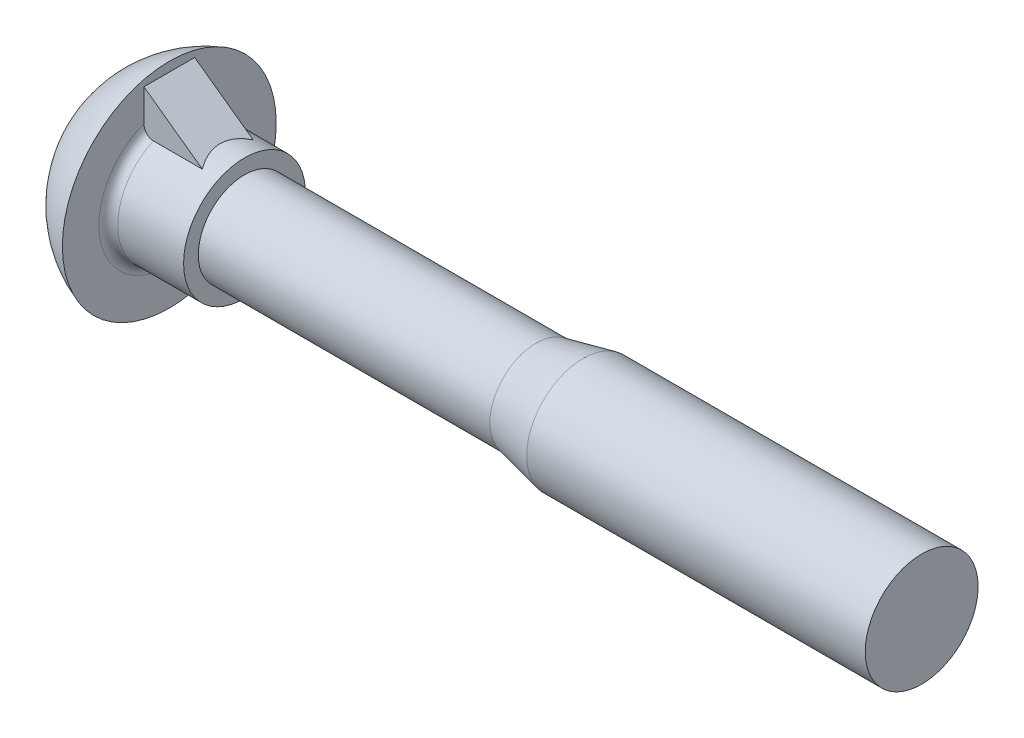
ISO-10303-21;
HEADER;
FILE_DESCRIPTION(('STEP AP214'),'2;1');
FILE_NAME('part.step','',(''),(''),'','','');
FILE_SCHEMA(('AUTOMOTIVE_DESIGN { 1 0 10303 214 1 1 1 1 }'));
ENDSEC;
DATA;
#1=APPLICATION_CONTEXT('core data for automotive mechanical design processes');
#2=APPLICATION_PROTOCOL_DEFINITION('international standard','automotive_design',2000,#1);
#3=PRODUCT_CONTEXT('',#1,'mechanical');
#4=PRODUCT('Part','Part','',(#3));
#5=PRODUCT_RELATED_PRODUCT_CATEGORY('part','',(#4));
#6=PRODUCT_DEFINITION_FORMATION('','',#4);
#7=PRODUCT_DEFINITION_CONTEXT('part definition',#1,'design');
#8=PRODUCT_DEFINITION('design','',#6,#7);
#9=PRODUCT_DEFINITION_SHAPE('','',#8);
#10=(LENGTH_UNIT() NAMED_UNIT(*) SI_UNIT(.MILLI.,.METRE.));
#11=(NAMED_UNIT(*) PLANE_ANGLE_UNIT() SI_UNIT($,.RADIAN.));
#12=(NAMED_UNIT(*) SI_UNIT($,.STERADIAN.) SOLID_ANGLE_UNIT());
#13=UNCERTAINTY_MEASURE_WITH_UNIT(LENGTH_MEASURE(1.E-05),#10,'distance_accuracy_value','');
#14=(GEOMETRIC_REPRESENTATION_CONTEXT(3) GLOBAL_UNCERTAINTY_ASSIGNED_CONTEXT((#13)) GLOBAL_UNIT_ASSIGNED_CONTEXT((#10,
#11,#12)) REPRESENTATION_CONTEXT('',''));
#15=CARTESIAN_POINT('',(0.,0.,0.));
#16=DIRECTION('',(0.,0.,1.));
#17=DIRECTION('',(1.,0.,0.));
#18=AXIS2_PLACEMENT_3D('',#15,#16,#17);
#19=CARTESIAN_POINT('',(4.58,0.,0.));
#20=DIRECTION('',(-1.,0.,0.));
#21=DIRECTION('',(0.,0.,1.));
#22=AXIS2_PLACEMENT_3D('',#19,#20,#21);
#23=TOROIDAL_SURFACE('',#22,3.74000000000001,0.5);
#24=CARTESIAN_POINT('',(4.27855518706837,3.05620140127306,1.35));
#25=CARTESIAN_POINT('',(4.25509222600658,3.07558616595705,1.35));
#26=CARTESIAN_POINT('',(4.23333891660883,3.09709315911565,1.35));
#27=CARTESIAN_POINT('',(4.19377598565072,3.14351633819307,1.35));
#28=CARTESIAN_POINT('',(4.17597568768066,3.16844036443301,1.35));
#29=CARTESIAN_POINT('',(4.14475397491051,3.22077385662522,1.35));
#30=CARTESIAN_POINT('',(4.13131761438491,3.24817441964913,1.35));
#31=CARTESIAN_POINT('',(4.10898689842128,3.30474701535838,1.35));
#32=CARTESIAN_POINT('',(4.10009071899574,3.33391833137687,1.35));
#33=CARTESIAN_POINT('',(4.0866653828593,3.39480417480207,1.35));
#34=CARTESIAN_POINT('',(4.0823800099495,3.42657269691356,1.35));
#35=CARTESIAN_POINT('',(4.07911978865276,3.49038954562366,1.35));
#36=CARTESIAN_POINT('',(4.08014633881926,3.52243794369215,1.35));
#37=CARTESIAN_POINT('',(4.0876044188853,3.58634778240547,1.35));
#38=CARTESIAN_POINT('',(4.09410905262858,3.61820079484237,1.35));
#39=CARTESIAN_POINT('',(4.11255369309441,3.68029787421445,1.35));
#40=CARTESIAN_POINT('',(4.12449293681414,3.71054216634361,1.35));
#41=CARTESIAN_POINT('',(4.1531129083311,3.76746837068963,1.35));
#42=CARTESIAN_POINT('',(4.16962594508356,3.79423439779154,1.35));
#43=CARTESIAN_POINT('',(4.20716929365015,3.84438967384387,1.35));
#44=CARTESIAN_POINT('',(4.22819802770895,3.86778009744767,1.35));
#45=CARTESIAN_POINT('',(4.27287749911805,3.90906375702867,1.35));
#46=CARTESIAN_POINT('',(4.29630718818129,3.92719616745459,1.35));
#47=CARTESIAN_POINT('',(4.34602673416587,3.95899047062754,1.35));
#48=CARTESIAN_POINT('',(4.37231553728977,3.97265400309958,1.35));
#49=CARTESIAN_POINT('',(4.42540303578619,3.99433569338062,1.35));
#50=CARTESIAN_POINT('',(4.45208987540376,4.00262816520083,1.35));
#51=CARTESIAN_POINT('',(4.50649975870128,4.01443225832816,1.35));
#52=CARTESIAN_POINT('',(4.53422254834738,4.01794504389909,1.35));
#53=CARTESIAN_POINT('',(4.58887541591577,4.0200184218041,1.35));
#54=CARTESIAN_POINT('',(4.61579922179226,4.0187482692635,1.35));
#55=CARTESIAN_POINT('',(4.66904340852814,4.01167983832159,1.35));
#56=CARTESIAN_POINT('',(4.69536383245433,4.00588188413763,1.35));
#57=CARTESIAN_POINT('',(4.74653524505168,3.99000557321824,1.35));
#58=CARTESIAN_POINT('',(4.77139277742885,3.97994824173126,1.35));
#59=CARTESIAN_POINT('',(4.81912300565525,3.9559007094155,1.35));
#60=CARTESIAN_POINT('',(4.84199554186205,3.94191019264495,1.35));
#61=CARTESIAN_POINT('',(4.88573665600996,3.91005488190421,1.35));
#62=CARTESIAN_POINT('',(4.90654133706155,3.89210247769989,1.35));
#63=CARTESIAN_POINT('',(4.94500824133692,3.85310255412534,1.35));
#64=CARTESIAN_POINT('',(4.9626698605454,3.83205444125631,1.35));
#65=CARTESIAN_POINT('',(4.99525393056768,3.78641018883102,1.35));
#66=CARTESIAN_POINT('',(5.01000696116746,3.76169319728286,1.35));
#67=CARTESIAN_POINT('',(5.03541218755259,3.71023711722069,1.35));
#68=CARTESIAN_POINT('',(5.04606332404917,3.68349750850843,1.35));
#69=CARTESIAN_POINT('',(5.0635994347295,3.62712355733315,1.35));
#70=CARTESIAN_POINT('',(5.07023353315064,3.59741114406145,1.35));
#71=CARTESIAN_POINT('',(5.07867680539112,3.53730836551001,1.35));
#72=CARTESIAN_POINT('',(5.08048466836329,3.50691781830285,1.35));
#73=CARTESIAN_POINT('',(5.07926490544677,3.4447355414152,1.35));
#74=CARTESIAN_POINT('',(5.07599518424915,3.41294837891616,1.35));
#75=CARTESIAN_POINT('',(5.06426982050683,3.350339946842,1.35));
#76=CARTESIAN_POINT('',(5.05581311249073,3.31951887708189,1.35));
#77=CARTESIAN_POINT('',(5.03369254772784,3.25916247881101,1.35));
#78=CARTESIAN_POINT('',(5.01993715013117,3.22966054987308,1.35));
#79=CARTESIAN_POINT('',(4.98750915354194,3.17348346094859,1.35));
#80=CARTESIAN_POINT('',(4.96883682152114,3.14680814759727,1.35));
#81=CARTESIAN_POINT('',(4.92766860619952,3.09807233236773,1.35));
#82=CARTESIAN_POINT('',(4.90531885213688,3.07588880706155,1.35));
#83=CARTESIAN_POINT('',(4.85693134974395,3.03598619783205,1.35));
#84=CARTESIAN_POINT('',(4.83089573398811,3.01826454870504,1.35));
#85=CARTESIAN_POINT('',(4.77810417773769,2.98935722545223,1.35));
#86=CARTESIAN_POINT('',(4.75157283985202,2.97776182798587,1.35));
#87=CARTESIAN_POINT('',(4.69683239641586,2.95965310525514,1.35));
#88=CARTESIAN_POINT('',(4.66862447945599,2.95313622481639,1.35));
#89=CARTESIAN_POINT('',(4.61386642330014,2.94584791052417,1.35));
#90=CARTESIAN_POINT('',(4.58737313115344,2.9446443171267,1.35));
#91=CARTESIAN_POINT('',(4.53457499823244,2.94685690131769,1.35));
#92=CARTESIAN_POINT('',(4.50827017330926,2.95027346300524,1.35));
#93=CARTESIAN_POINT('',(4.45741721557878,2.96139141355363,1.35));
#94=CARTESIAN_POINT('',(4.43284008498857,2.96896188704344,1.35));
#95=CARTESIAN_POINT('',(4.38525991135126,2.98797094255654,1.35));
#96=CARTESIAN_POINT('',(4.36225501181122,2.99940486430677,1.35));
#97=CARTESIAN_POINT('',(4.32947205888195,3.01902693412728,1.35));
#98=CARTESIAN_POINT('',(4.31889899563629,3.02592358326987,1.35));
#99=CARTESIAN_POINT('',(4.29830444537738,3.04049243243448,1.35));
#100=CARTESIAN_POINT('',(4.28828287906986,3.04816452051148,1.35));
#101=CARTESIAN_POINT('',(4.27855518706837,3.05620140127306,1.35));
#102=B_SPLINE_CURVE_WITH_KNOTS('',3,(#24,#25,#26,#27,#28,#29,#30,#31,#32,#33,#34,#35,#36,#37,
#38,#39,#40,#41,#42,#43,#44,#45,#46,#47,#48,#49,#50,#51,#52,#53,#54,#55,#56,#57,#58,#59,#60,#61,
#62,#63,#64,#65,#66,#67,#68,#69,#70,#71,#72,#73,#74,#75,#76,#77,#78,#79,#80,#81,#82,#83,#84,#85,
#86,#87,#88,#89,#90,#91,#92,#93,#94,#95,#96,#97,#98,#99,#100,#101),.UNSPECIFIED.,.T.,.F.,(4,2,2,
2,2,2,2,2,2,2,2,2,2,2,2,2,2,2,2,2,2,2,2,2,2,2,2,2,2,2,2,2,2,2,2,2,2,2,4),(0.,0.091255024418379,
0.182723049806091,0.273874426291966,0.364989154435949,0.460714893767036,0.556465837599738,
0.653515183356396,0.750550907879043,0.844415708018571,0.938247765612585,1.02667039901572,
1.1150605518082,1.19847888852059,1.28187690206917,1.36235188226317,1.44282110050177,
1.52289765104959,1.60298063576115,1.68505302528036,1.76714117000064,1.85311847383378,
1.93911796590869,2.03004702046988,2.12100076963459,2.21642605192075,2.31187094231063,
2.40904459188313,2.50621296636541,2.60018213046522,2.69409714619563,2.78049226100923,
2.86682684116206,2.94599227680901,3.02516429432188,3.1019735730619,3.17869052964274,
3.2165301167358,3.25436424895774),.UNSPECIFIED.);
#103=CARTESIAN_POINT('',(4.58,2.94535227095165,1.35));
#104=VERTEX_POINT('',#103);
#105=CARTESIAN_POINT('',(4.08,3.487850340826,1.35));
#106=VERTEX_POINT('',#105);
#107=EDGE_CURVE('E163',#104,#106,#102,.T.);
#108=ORIENTED_EDGE('',*,*,#107,.T.);
#109=CARTESIAN_POINT('',(4.08,0.,0.));
#110=DIRECTION('',(-1.,0.,0.));
#111=DIRECTION('',(0.,0.,1.));
#112=AXIS2_PLACEMENT_3D('',#109,#110,#111);
#113=CIRCLE('',#112,3.74000000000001);
#114=CARTESIAN_POINT('',(4.08,3.487850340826,-1.35));
#115=VERTEX_POINT('',#114);
#116=EDGE_CURVE('E166',#115,#106,#113,.T.);
#117=ORIENTED_EDGE('',*,*,#116,.F.);
#118=CARTESIAN_POINT('',(4.27855518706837,3.05620140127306,-1.35));
#119=CARTESIAN_POINT('',(4.25509222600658,3.07558616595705,-1.35));
#120=CARTESIAN_POINT('',(4.23333891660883,3.09709315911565,-1.35));
#121=CARTESIAN_POINT('',(4.19377598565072,3.14351633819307,-1.35));
#122=CARTESIAN_POINT('',(4.17597568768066,3.16844036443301,-1.35));
#123=CARTESIAN_POINT('',(4.14475397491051,3.22077385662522,-1.35));
#124=CARTESIAN_POINT('',(4.13131761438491,3.24817441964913,-1.35));
#125=CARTESIAN_POINT('',(4.10898689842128,3.30474701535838,-1.35));
#126=CARTESIAN_POINT('',(4.10009071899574,3.33391833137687,-1.35));
#127=CARTESIAN_POINT('',(4.0866653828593,3.39480417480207,-1.35));
#128=CARTESIAN_POINT('',(4.0823800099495,3.42657269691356,-1.35));
#129=CARTESIAN_POINT('',(4.07911978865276,3.49038954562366,-1.35));
#130=CARTESIAN_POINT('',(4.08014633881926,3.52243794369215,-1.35));
#131=CARTESIAN_POINT('',(4.0876044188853,3.58634778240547,-1.35));
#132=CARTESIAN_POINT('',(4.09410905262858,3.61820079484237,-1.35));
#133=CARTESIAN_POINT('',(4.11255369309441,3.68029787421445,-1.35));
#134=CARTESIAN_POINT('',(4.12449293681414,3.71054216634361,-1.35));
#135=CARTESIAN_POINT('',(4.1531129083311,3.76746837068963,-1.35));
#136=CARTESIAN_POINT('',(4.16962594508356,3.79423439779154,-1.35));
#137=CARTESIAN_POINT('',(4.20716929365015,3.84438967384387,-1.35));
#138=CARTESIAN_POINT('',(4.22819802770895,3.86778009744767,-1.35));
#139=CARTESIAN_POINT('',(4.27287749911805,3.90906375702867,-1.35));
#140=CARTESIAN_POINT('',(4.29630718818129,3.92719616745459,-1.35));
#141=CARTESIAN_POINT('',(4.34602673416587,3.95899047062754,-1.35));
#142=CARTESIAN_POINT('',(4.37231553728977,3.97265400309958,-1.35));
#143=CARTESIAN_POINT('',(4.42540303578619,3.99433569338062,-1.35));
#144=CARTESIAN_POINT('',(4.45208987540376,4.00262816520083,-1.35));
#145=CARTESIAN_POINT('',(4.50649975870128,4.01443225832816,-1.35));
#146=CARTESIAN_POINT('',(4.53422254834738,4.01794504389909,-1.35));
#147=CARTESIAN_POINT('',(4.58887541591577,4.0200184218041,-1.35));
#148=CARTESIAN_POINT('',(4.61579922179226,4.0187482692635,-1.35));
#149=CARTESIAN_POINT('',(4.66904340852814,4.01167983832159,-1.35));
#150=CARTESIAN_POINT('',(4.69536383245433,4.00588188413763,-1.35));
#151=CARTESIAN_POINT('',(4.74653524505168,3.99000557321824,-1.35));
#152=CARTESIAN_POINT('',(4.77139277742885,3.97994824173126,-1.35));
#153=CARTESIAN_POINT('',(4.81912300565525,3.9559007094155,-1.35));
#154=CARTESIAN_POINT('',(4.84199554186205,3.94191019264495,-1.35));
#155=CARTESIAN_POINT('',(4.88573665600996,3.91005488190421,-1.35));
#156=CARTESIAN_POINT('',(4.90654133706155,3.89210247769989,-1.35));
#157=CARTESIAN_POINT('',(4.94500824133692,3.85310255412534,-1.35));
#158=CARTESIAN_POINT('',(4.9626698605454,3.83205444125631,-1.35));
#159=CARTESIAN_POINT('',(4.99525393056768,3.78641018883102,-1.35));
#160=CARTESIAN_POINT('',(5.01000696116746,3.76169319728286,-1.35));
#161=CARTESIAN_POINT('',(5.03541218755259,3.71023711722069,-1.35));
#162=CARTESIAN_POINT('',(5.04606332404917,3.68349750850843,-1.35));
#163=CARTESIAN_POINT('',(5.0635994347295,3.62712355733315,-1.35));
#164=CARTESIAN_POINT('',(5.07023353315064,3.59741114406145,-1.35));
#165=CARTESIAN_POINT('',(5.07867680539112,3.53730836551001,-1.35));
#166=CARTESIAN_POINT('',(5.08048466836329,3.50691781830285,-1.35));
#167=CARTESIAN_POINT('',(5.07926490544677,3.4447355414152,-1.35));
#168=CARTESIAN_POINT('',(5.07599518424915,3.41294837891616,-1.35));
#169=CARTESIAN_POINT('',(5.06426982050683,3.350339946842,-1.35));
#170=CARTESIAN_POINT('',(5.05581311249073,3.31951887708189,-1.35));
#171=CARTESIAN_POINT('',(5.03369254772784,3.25916247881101,-1.35));
#172=CARTESIAN_POINT('',(5.01993715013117,3.22966054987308,-1.35));
#173=CARTESIAN_POINT('',(4.98750915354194,3.17348346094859,-1.35));
#174=CARTESIAN_POINT('',(4.96883682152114,3.14680814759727,-1.35));
#175=CARTESIAN_POINT('',(4.92766860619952,3.09807233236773,-1.35));
#176=CARTESIAN_POINT('',(4.90531885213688,3.07588880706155,-1.35));
#177=CARTESIAN_POINT('',(4.85693134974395,3.03598619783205,-1.35));
#178=CARTESIAN_POINT('',(4.83089573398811,3.01826454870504,-1.35));
#179=CARTESIAN_POINT('',(4.77810417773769,2.98935722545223,-1.35));
#180=CARTESIAN_POINT('',(4.75157283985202,2.97776182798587,-1.35));
#181=CARTESIAN_POINT('',(4.69683239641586,2.95965310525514,-1.35));
#182=CARTESIAN_POINT('',(4.66862447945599,2.95313622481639,-1.35));
#183=CARTESIAN_POINT('',(4.61386642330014,2.94584791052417,-1.35));
#184=CARTESIAN_POINT('',(4.58737313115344,2.9446443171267,-1.35));
#185=CARTESIAN_POINT('',(4.53457499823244,2.94685690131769,-1.35));
#186=CARTESIAN_POINT('',(4.50827017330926,2.95027346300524,-1.35));
#187=CARTESIAN_POINT('',(4.45741721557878,2.96139141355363,-1.35));
#188=CARTESIAN_POINT('',(4.43284008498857,2.96896188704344,-1.35));
#189=CARTESIAN_POINT('',(4.38525991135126,2.98797094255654,-1.35));
#190=CARTESIAN_POINT('',(4.36225501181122,2.99940486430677,-1.35));
#191=CARTESIAN_POINT('',(4.32947205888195,3.01902693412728,-1.35));
#192=CARTESIAN_POINT('',(4.31889899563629,3.02592358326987,-1.35));
#193=CARTESIAN_POINT('',(4.29830444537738,3.04049243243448,-1.35));
#194=CARTESIAN_POINT('',(4.28828287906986,3.04816452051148,-1.35));
#195=CARTESIAN_POINT('',(4.27855518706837,3.05620140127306,-1.35));
#196=B_SPLINE_CURVE_WITH_KNOTS('',3,(#118,#119,#120,#121,#122,#123,#124,#125,#126,#127,#128,
#129,#130,#131,#132,#133,#134,#135,#136,#137,#138,#139,#140,#141,#142,#143,#144,#145,#146,#147,
#148,#149,#150,#151,#152,#153,#154,#155,#156,#157,#158,#159,#160,#161,#162,#163,#164,#165,#166,
#167,#168,#169,#170,#171,#172,#173,#174,#175,#176,#177,#178,#179,#180,#181,#182,#183,#184,#185,
#186,#187,#188,#189,#190,#191,#192,#193,#194,#195),.UNSPECIFIED.,.T.,.F.,(4,2,2,2,2,2,2,2,2,2,2,
2,2,2,2,2,2,2,2,2,2,2,2,2,2,2,2,2,2,2,2,2,2,2,2,2,2,2,4),(0.,0.091255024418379,
0.182723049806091,0.273874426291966,0.364989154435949,0.460714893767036,0.556465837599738,
0.653515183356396,0.750550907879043,0.844415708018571,0.938247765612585,1.02667039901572,
1.1150605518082,1.19847888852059,1.28187690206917,1.36235188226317,1.44282110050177,
1.52289765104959,1.60298063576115,1.68505302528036,1.76714117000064,1.85311847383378,
1.93911796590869,2.03004702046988,2.12100076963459,2.21642605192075,2.31187094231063,
2.40904459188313,2.50621296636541,2.60018213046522,2.69409714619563,2.78049226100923,
2.86682684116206,2.94599227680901,3.02516429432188,3.1019735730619,3.17869052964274,
3.2165301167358,3.25436424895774),.UNSPECIFIED.);
#197=CARTESIAN_POINT('',(4.58,2.94535227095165,-1.35));
#198=VERTEX_POINT('',#197);
#199=EDGE_CURVE('E105',#198,#115,#196,.T.);
#200=ORIENTED_EDGE('',*,*,#199,.F.);
#201=CARTESIAN_POINT('',(4.58,0.,0.));
#202=DIRECTION('',(-1.,0.,0.));
#203=DIRECTION('',(0.,0.,1.));
#204=AXIS2_PLACEMENT_3D('',#201,#202,#203);
#205=CIRCLE('',#204,3.24000000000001);
#206=EDGE_CURVE('E101',#198,#104,#205,.T.);
#207=ORIENTED_EDGE('',*,*,#206,.T.);
#208=EDGE_LOOP('',(#108,#117,#200,#207));
#209=FACE_BOUND('',#208,.T.);
#210=ADVANCED_FACE('F50',(#209),#23,.F.);
#211=CARTESIAN_POINT('',(-31.4843454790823,0.,0.));
#212=DIRECTION('',(-1.,0.,0.));
#213=DIRECTION('',(0.,0.,1.));
#214=AXIS2_PLACEMENT_3D('',#211,#212,#213);
#215=CYLINDRICAL_SURFACE('',#214,3.24000000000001);
#216=CARTESIAN_POINT('',(8.08,0.,0.));
#217=DIRECTION('',(-1.,0.,0.));
#218=DIRECTION('',(0.,0.,1.));
#219=AXIS2_PLACEMENT_3D('',#216,#217,#218);
#220=CIRCLE('',#219,3.24000000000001);
#221=CARTESIAN_POINT('',(8.08,0.,3.24000000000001));
#222=VERTEX_POINT('',#221);
#223=EDGE_CURVE('E160',#222,#222,#220,.T.);
#224=ORIENTED_EDGE('',*,*,#223,.T.);
#225=EDGE_LOOP('',(#224));
#226=FACE_BOUND('',#225,.T.);
#227=DIRECTION('',(-1.,0.,0.));
#228=VECTOR('',#227,1.);
#229=CARTESIAN_POINT('',(-31.4843454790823,2.94535227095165,1.35));
#230=LINE('',#229,#228);
#231=CARTESIAN_POINT('',(7.18912662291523,2.94535227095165,1.35));
#232=VERTEX_POINT('',#231);
#233=EDGE_CURVE('E156',#232,#104,#230,.T.);
#234=ORIENTED_EDGE('',*,*,#233,.T.);
#235=ORIENTED_EDGE('',*,*,#206,.F.);
#236=DIRECTION('',(-1.,0.,0.));
#237=VECTOR('',#236,1.);
#238=CARTESIAN_POINT('',(-31.4843454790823,2.94535227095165,-1.35));
#239=LINE('',#238,#237);
#240=CARTESIAN_POINT('',(7.18912662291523,2.94535227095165,-1.35));
#241=VERTEX_POINT('',#240);
#242=EDGE_CURVE('E70',#241,#198,#239,.T.);
#243=ORIENTED_EDGE('',*,*,#242,.F.);
#244=CARTESIAN_POINT('',(11.2788307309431,0.,0.));
#245=DIRECTION('',(0.584404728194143,0.811462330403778,0.));
#246=DIRECTION('',(-0.811462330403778,0.584404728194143,0.));
#247=AXIS2_PLACEMENT_3D('',#244,#245,#246);
#248=ELLIPSE('',#247,5.54410298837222,3.24000000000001);
#249=EDGE_CURVE('E65',#241,#232,#248,.T.);
#250=ORIENTED_EDGE('',*,*,#249,.T.);
#251=EDGE_LOOP('',(#234,#235,#243,#250));
#252=FACE_BOUND('',#251,.T.);
#253=ADVANCED_FACE('F150',(#226,#252),#215,.T.);
#254=CARTESIAN_POINT('',(8.08,3.,0.));
#255=DIRECTION('',(-1.,0.,0.));
#256=DIRECTION('',(0.,0.,1.));
#257=AXIS2_PLACEMENT_3D('',#254,#255,#256);
#258=PLANE('',#257);
#259=ORIENTED_EDGE('',*,*,#223,.F.);
#260=EDGE_LOOP('',(#259));
#261=FACE_BOUND('',#260,.T.);
#262=CARTESIAN_POINT('',(8.08,0.,0.));
#263=DIRECTION('',(-1.,0.,0.));
#264=DIRECTION('',(0.,0.,1.));
#265=AXIS2_PLACEMENT_3D('',#262,#263,#264);
#266=CIRCLE('',#265,2.4585);
#267=CARTESIAN_POINT('',(8.08,0.,2.4585));
#268=VERTEX_POINT('',#267);
#269=EDGE_CURVE('E110',#268,#268,#266,.T.);
#270=ORIENTED_EDGE('',*,*,#269,.T.);
#271=EDGE_LOOP('',(#270));
#272=FACE_BOUND('',#271,.T.);
#273=ADVANCED_FACE('F134',(#261,#272),#258,.F.);
#274=CARTESIAN_POINT('',(6.,0.,0.));
#275=DIRECTION('',(-1.,0.,0.));
#276=DIRECTION('',(0.,1.,0.));
#277=AXIS2_PLACEMENT_3D('',#274,#275,#276);
#278=SPHERICAL_SURFACE('',#277,6.);
#279=CARTESIAN_POINT('',(4.08,0.,0.));
#280=DIRECTION('',(-1.,0.,0.));
#281=DIRECTION('',(0.,0.,1.));
#282=AXIS2_PLACEMENT_3D('',#279,#280,#281);
#283=CIRCLE('',#282,5.68450525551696);
#284=CARTESIAN_POINT('',(4.08,0.,5.68450525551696));
#285=VERTEX_POINT('',#284);
#286=EDGE_CURVE('E167',#285,#285,#283,.T.);
#287=ORIENTED_EDGE('',*,*,#286,.T.);
#288=EDGE_LOOP('',(#287));
#289=FACE_BOUND('',#288,.T.);
#290=ADVANCED_FACE('F135',(#289),#278,.T.);
#291=CARTESIAN_POINT('',(4.08,3.74000000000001,0.));
#292=DIRECTION('',(-1.,0.,0.));
#293=DIRECTION('',(0.,0.,1.));
#294=AXIS2_PLACEMENT_3D('',#291,#292,#293);
#295=PLANE('',#294);
#296=ORIENTED_EDGE('',*,*,#116,.T.);
#297=DIRECTION('',(0.,1.,0.));
#298=VECTOR('',#297,1.);
#299=CARTESIAN_POINT('',(4.08,3.74000000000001,1.35));
#300=LINE('',#299,#298);
#301=CARTESIAN_POINT('',(4.08,5.18450525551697,1.35));
#302=VERTEX_POINT('',#301);
#303=EDGE_CURVE('E11',#106,#302,#300,.T.);
#304=ORIENTED_EDGE('',*,*,#303,.T.);
#305=DIRECTION('',(0.,0.,-1.));
#306=VECTOR('',#305,1.);
#307=CARTESIAN_POINT('',(4.08,5.18450525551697,0.));
#308=LINE('',#307,#306);
#309=CARTESIAN_POINT('',(4.08,5.18450525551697,-1.35));
#310=VERTEX_POINT('',#309);
#311=EDGE_CURVE('E54',#302,#310,#308,.T.);
#312=ORIENTED_EDGE('',*,*,#311,.T.);
#313=DIRECTION('',(0.,1.,0.));
#314=VECTOR('',#313,1.);
#315=CARTESIAN_POINT('',(4.08,3.74000000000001,-1.35));
#316=LINE('',#315,#314);
#317=EDGE_CURVE('E89',#115,#310,#316,.T.);
#318=ORIENTED_EDGE('',*,*,#317,.F.);
#319=EDGE_LOOP('',(#296,#304,#312,#318));
#320=FACE_BOUND('',#319,.T.);
#321=ORIENTED_EDGE('',*,*,#286,.F.);
#322=EDGE_LOOP('',(#321));
#323=FACE_BOUND('',#322,.T.);
#324=ADVANCED_FACE('F86',(#320,#323),#295,.F.);
#325=CARTESIAN_POINT('',(6.78,3.24000000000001,0.));
#326=DIRECTION('',(0.584404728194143,0.811462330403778,0.));
#327=DIRECTION('',(-0.811462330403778,0.584404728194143,0.));
#328=AXIS2_PLACEMENT_3D('',#325,#326,#327);
#329=PLANE('',#328);
#330=ORIENTED_EDGE('',*,*,#249,.F.);
#331=DIRECTION('',(-0.811462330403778,0.584404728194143,0.));
#332=VECTOR('',#331,1.);
#333=CARTESIAN_POINT('',(6.78,3.24000000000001,-1.35));
#334=LINE('',#333,#332);
#335=EDGE_CURVE('E103',#241,#310,#334,.T.);
#336=ORIENTED_EDGE('',*,*,#335,.T.);
#337=ORIENTED_EDGE('',*,*,#311,.F.);
#338=DIRECTION('',(-0.811462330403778,0.584404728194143,0.));
#339=VECTOR('',#338,1.);
#340=CARTESIAN_POINT('',(6.78,3.24000000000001,1.35));
#341=LINE('',#340,#339);
#342=EDGE_CURVE('E106',#232,#302,#341,.T.);
#343=ORIENTED_EDGE('',*,*,#342,.F.);
#344=EDGE_LOOP('',(#330,#336,#337,#343));
#345=FACE_BOUND('',#344,.T.);
#346=ADVANCED_FACE('F102',(#345),#329,.T.);
#347=CARTESIAN_POINT('',(22.04,0.,1.35));
#348=DIRECTION('',(0.,0.,1.));
#349=DIRECTION('',(1.,0.,0.));
#350=AXIS2_PLACEMENT_3D('',#347,#348,#349);
#351=PLANE('',#350);
#352=ORIENTED_EDGE('',*,*,#303,.F.);
#353=ORIENTED_EDGE('',*,*,#107,.F.);
#354=ORIENTED_EDGE('',*,*,#233,.F.);
#355=ORIENTED_EDGE('',*,*,#342,.T.);
#356=EDGE_LOOP('',(#352,#353,#354,#355));
#357=FACE_BOUND('',#356,.T.);
#358=ADVANCED_FACE('F123',(#357),#351,.T.);
#359=CARTESIAN_POINT('',(22.04,0.,-1.35));
#360=DIRECTION('',(0.,0.,1.));
#361=DIRECTION('',(1.,0.,0.));
#362=AXIS2_PLACEMENT_3D('',#359,#360,#361);
#363=PLANE('',#362);
#364=ORIENTED_EDGE('',*,*,#335,.F.);
#365=ORIENTED_EDGE('',*,*,#242,.T.);
#366=ORIENTED_EDGE('',*,*,#199,.T.);
#367=ORIENTED_EDGE('',*,*,#317,.T.);
#368=EDGE_LOOP('',(#364,#365,#366,#367));
#369=FACE_BOUND('',#368,.T.);
#370=ADVANCED_FACE('F99',(#369),#363,.F.);
#371=CARTESIAN_POINT('',(-29.8163416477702,0.,0.));
#372=DIRECTION('',(-1.,0.,0.));
#373=DIRECTION('',(0.,0.,1.));
#374=AXIS2_PLACEMENT_3D('',#371,#372,#373);
#375=CYLINDRICAL_SURFACE('',#374,2.4585);
#376=CARTESIAN_POINT('',(23.58,0.,0.));
#377=DIRECTION('',(-1.,0.,0.));
#378=DIRECTION('',(0.,0.,1.));
#379=AXIS2_PLACEMENT_3D('',#376,#377,#378);
#380=CIRCLE('',#379,2.4585);
#381=CARTESIAN_POINT('',(23.58,0.,2.4585));
#382=VERTEX_POINT('',#381);
#383=EDGE_CURVE('E111',#382,#382,#380,.T.);
#384=ORIENTED_EDGE('',*,*,#383,.T.);
#385=EDGE_LOOP('',(#384));
#386=FACE_BOUND('',#385,.T.);
#387=ORIENTED_EDGE('',*,*,#269,.F.);
#388=EDGE_LOOP('',(#387));
#389=FACE_BOUND('',#388,.T.);
#390=ADVANCED_FACE('F121',(#386,#389),#375,.T.);
#391=CARTESIAN_POINT('',(23.58,0.,0.));
#392=DIRECTION('',(1.,0.,0.));
#393=DIRECTION('',(0.,0.,-1.));
#394=AXIS2_PLACEMENT_3D('',#391,#392,#393);
#395=CONICAL_SURFACE('',#394,2.4585,0.21330496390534);
#396=CARTESIAN_POINT('',(26.08,0.,0.));
#397=DIRECTION('',(-1.,0.,0.));
#398=DIRECTION('',(0.,0.,1.));
#399=AXIS2_PLACEMENT_3D('',#396,#397,#398);
#400=CIRCLE('',#399,3.);
#401=CARTESIAN_POINT('',(26.08,0.,3.));
#402=VERTEX_POINT('',#401);
#403=EDGE_CURVE('E181',#402,#402,#400,.T.);
#404=ORIENTED_EDGE('',*,*,#403,.T.);
#405=EDGE_LOOP('',(#404));
#406=FACE_BOUND('',#405,.T.);
#407=ORIENTED_EDGE('',*,*,#383,.F.);
#408=EDGE_LOOP('',(#407));
#409=FACE_BOUND('',#408,.T.);
#410=ADVANCED_FACE('F142',(#406,#409),#395,.T.);
#411=CARTESIAN_POINT('',(44.08,0.,0.));
#412=DIRECTION('',(-1.,0.,0.));
#413=DIRECTION('',(0.,0.,1.));
#414=AXIS2_PLACEMENT_3D('',#411,#412,#413);
#415=PLANE('',#414);
#416=CARTESIAN_POINT('',(44.08,0.,0.));
#417=DIRECTION('',(-1.,0.,0.));
#418=DIRECTION('',(0.,0.,1.));
#419=AXIS2_PLACEMENT_3D('',#416,#417,#418);
#420=CIRCLE('',#419,3.);
#421=CARTESIAN_POINT('',(44.08,0.,3.));
#422=VERTEX_POINT('',#421);
#423=EDGE_CURVE('E173',#422,#422,#420,.T.);
#424=ORIENTED_EDGE('',*,*,#423,.F.);
#425=EDGE_LOOP('',(#424));
#426=FACE_BOUND('',#425,.T.);
#427=ADVANCED_FACE('F140',(#426),#415,.F.);
#428=CARTESIAN_POINT('',(-31.4843454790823,0.,0.));
#429=DIRECTION('',(-1.,0.,0.));
#430=DIRECTION('',(0.,0.,1.));
#431=AXIS2_PLACEMENT_3D('',#428,#429,#430);
#432=CYLINDRICAL_SURFACE('',#431,3.);
#433=ORIENTED_EDGE('',*,*,#423,.T.);
#434=EDGE_LOOP('',(#433));
#435=FACE_BOUND('',#434,.T.);
#436=ORIENTED_EDGE('',*,*,#403,.F.);
#437=EDGE_LOOP('',(#436));
#438=FACE_BOUND('',#437,.T.);
#439=ADVANCED_FACE('F137',(#435,#438),#432,.T.);
#440=CLOSED_SHELL('',(#210,#253,#273,#290,#324,#346,#358,#370,#390,#410,#427,#439));
#441=MANIFOLD_SOLID_BREP('B2',#440);
#442=ADVANCED_BREP_SHAPE_REPRESENTATION('',(#18,#441),#14);
#443=SHAPE_DEFINITION_REPRESENTATION(#9,#442);
ENDSEC;
END-ISO-10303-21;
